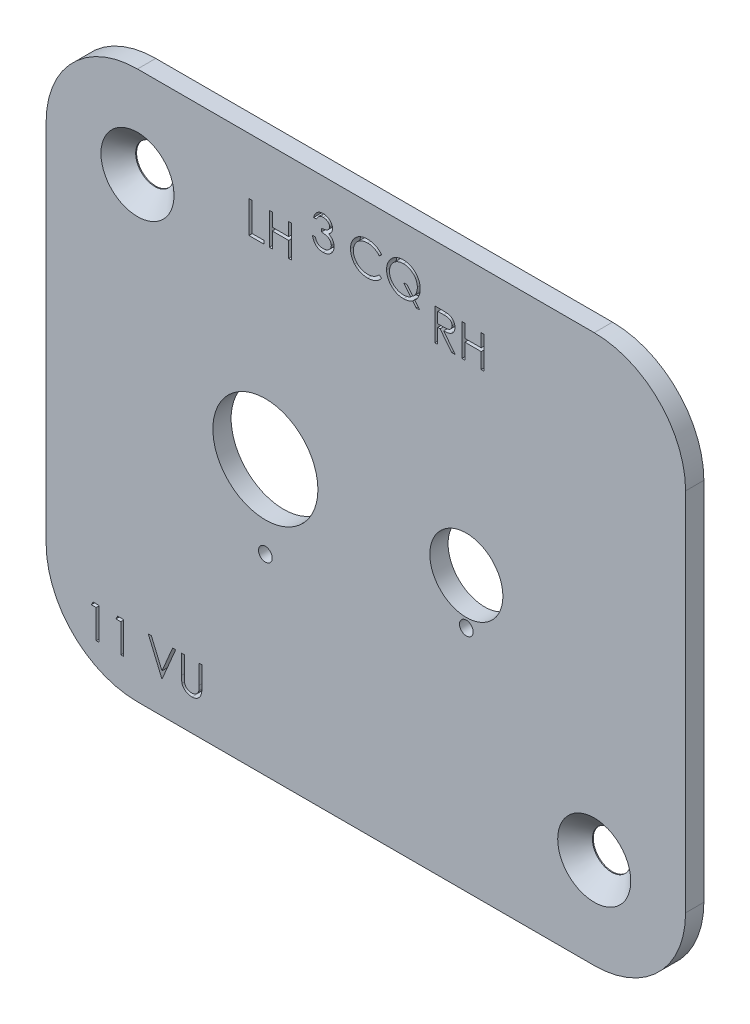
from build123d import *

# Parameters (mm, degrees)
ESQUISSE1_W             = 70
ESQUISSE1_H             = 60
BOSS_EXTRU_1_DEPTH      = 2
CONG_1_R                = 10
ESQUISSE2_R             = 2.1
ENL_V_MAT_EXTRU_1_DEPTH = 93.217135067
CHANFREIN1_SIZE         = 1.9
ENL_V_MAT_EXTRU_4_DEPTH = 1
ESQUISSE5_R             = 5.75
ESQUISSE5_R_2           = 4
ESQUISSE5_R_3           = 0.75
ENL_V_MAT_EXTRU_5_DEPTH = 93.217135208


with BuildPart() as part:
    # Esquisse1 → Boss.-Extru.1 (new body)
    with BuildSketch(Plane.XY):
        with Locations((35, 30)):
            Rectangle(ESQUISSE1_W, ESQUISSE1_H)
    extrude(amount=-BOSS_EXTRU_1_DEPTH)

    # Cong_1
    cong_1_edges = [part.edges().sort_by_distance(p)[0] for p in [
        (0, 60, -1),
        (70, 60, -1),
        (70, 0, -1),
        (0, 0, -1),
    ]]
    fillet(cong_1_edges, radius=CONG_1_R)

    # Esquisse2 → Enl_v. mat.-Extru.1 (cut, through all)
    with BuildSketch(Plane.XY):
        with Locations((10, 50)):
            Circle(ESQUISSE2_R)
        with Locations((60, 10)):
            Circle(ESQUISSE2_R)
    extrude(amount=-ENL_V_MAT_EXTRU_1_DEPTH, mode=Mode.SUBTRACT)

    # Chanfrein1
    chanfrein1_edges = [part.edges().sort_by_distance(p)[0] for p in [
        (7.9, 50, 0),
        (57.9, 10, 0),
    ]]
    chamfer(chanfrein1_edges, length=CHANFREIN1_SIZE)

    # Esquisse4 → Enl_v. mat.-Extru.4 (cut)
    # profile 1 of 11: a face of its own
    with BuildSketch(Plane.XY):
        Polygon((22.198120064, 53.814922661), (22.512222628, 53.814922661), (22.512222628, 50.67389702), (23.858376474, 50.67389702), (23.858376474, 50.314922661), (22.198120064, 50.314922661), align=None)
    # profile 2 of 11: a face of its own
    with BuildSketch(Plane.XY):
        Polygon((24.441709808, 53.814922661), (24.755812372, 53.814922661), (24.755812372, 52.379025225), (26.550684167, 52.379025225), (26.550684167, 53.814922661), (26.864786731, 53.814922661), (26.864786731, 50.314922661), (26.550684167, 50.314922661), (26.550684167, 52.020050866), (24.755812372, 52.020050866), (24.755812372, 50.314922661), (24.441709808, 50.314922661), align=None)
    # profile 3 of 11: a face of its own
    with BuildSketch(Plane.XY):
        with BuildLine():
            Line((42.552954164, 53.814922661), (43.253374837, 53.814922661))
            add(Edge.make_bspline(
                [(43.253374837, 53.814922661), (43.300115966, 53.814767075), (43.38986411, 53.814468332), (43.51843738, 53.812802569), (43.635264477, 53.808028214), (43.740284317, 53.80391963), (43.833494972, 53.796427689), (43.915182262, 53.789267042), (43.98496996, 53.779893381), (44.027215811, 53.771187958), (44.046343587, 53.767246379)],
                knots=[0, 0, 0, 0, 1.410062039, 2.707475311, 3.878576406, 4.937260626, 5.877586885, 6.699081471, 7.410979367, 8, 8, 8, 8], degree=3))
            add(Edge.make_bspline(
                [(44.046343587, 53.767246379), (44.071950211, 53.760919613), (44.122617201, 53.74840105), (44.195567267, 53.721941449), (44.265081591, 53.691321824), (44.330871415, 53.655358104), (44.392607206, 53.613783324), (44.450925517, 53.567315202), (44.50609098, 53.516207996), (44.555872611, 53.459173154), (44.602811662, 53.399336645), (44.642400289, 53.334632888), (44.676526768, 53.26697136), (44.703697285, 53.195663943), (44.725575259, 53.121402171), (44.741001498, 53.043513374), (44.750252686, 52.962352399), (44.751194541, 52.90699449), (44.751672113, 52.878925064)],
                knots=[0, 0, 0, 0, 1.027469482, 2.033020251, 3.019912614, 3.986113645, 4.951240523, 5.91722682, 6.890402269, 7.87763091, 8.8651537, 9.85103654, 10.82876324, 11.815024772, 12.821070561, 13.842952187, 14.906261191, 16, 16, 16, 16], degree=3))
            add(Edge.make_bspline(
                [(44.751672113, 52.878925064), (44.750203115, 52.83228996), (44.747336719, 52.741292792), (44.720611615, 52.609231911), (44.676835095, 52.486042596), (44.616511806, 52.371879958), (44.539692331, 52.268969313), (44.44736754, 52.178578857), (44.339485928, 52.102938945), (44.239056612, 52.05048614), (44.150342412, 52.016893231), (44.0773091, 51.993256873), (43.997642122, 51.974994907), (43.912104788, 51.958634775), (43.820341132, 51.946283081), (43.722571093, 51.937236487), (43.618724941, 51.931582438), (43.547385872, 51.930740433), (43.510686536, 51.930307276)],
                knots=[0, 0, 0, 0, 1.260483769, 2.459530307, 3.627416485, 4.787058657, 5.939039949, 7.08810263, 8.267026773, 9.491475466, 10.141966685, 10.831826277, 11.566392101, 12.351337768, 13.187381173, 14.07005841, 15.007169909, 16, 16, 16, 16], degree=3))
            Line((43.510686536, 51.930307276), (44.796543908, 50.314922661))
            Line((44.796543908, 50.314922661), (44.408122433, 50.314922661))
            Line((44.408122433, 50.314922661), (43.122265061, 51.930307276))
            Line((43.122265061, 51.930307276), (42.867056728, 51.930307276))
            Line((42.867056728, 51.930307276), (42.867056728, 50.314922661))
            Line((42.867056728, 50.314922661), (42.552954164, 50.314922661))
            Line((42.552954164, 50.314922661), (42.552954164, 53.814922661))
        make_face()
        with BuildLine():
            Line((42.867056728, 53.455948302), (42.867056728, 52.289281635))
            Line((42.867056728, 52.289281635), (43.507882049, 52.284373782))
            add(Edge.make_bspline(
                [(43.507882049, 52.284373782), (43.537802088, 52.284360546), (43.595795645, 52.284334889), (43.679696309, 52.288328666), (43.757816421, 52.292871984), (43.829857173, 52.299821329), (43.895850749, 52.308777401), (43.955764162, 52.319980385), (44.009695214, 52.333032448), (44.072593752, 52.353234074), (44.142830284, 52.385240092), (44.219161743, 52.431805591), (44.284164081, 52.49037471), (44.339081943, 52.557348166), (44.383211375, 52.630984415), (44.414323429, 52.710400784), (44.434065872, 52.793592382), (44.436394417, 52.85077049), (44.437569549, 52.879626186)],
                knots=[0, 0, 0, 0, 1.146690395, 2.22261258, 3.21895312, 4.145990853, 4.996080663, 5.770904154, 6.481378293, 7.121626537, 8.300444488, 9.431385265, 10.535395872, 11.636531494, 12.74115979, 13.810798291, 14.895190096, 16, 16, 16, 16], degree=3))
            add(Edge.make_bspline(
                [(44.437569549, 52.879626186), (44.436367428, 52.90777276), (44.433985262, 52.963548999), (44.414536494, 53.045204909), (44.381647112, 53.122271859), (44.337324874, 53.194436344), (44.283325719, 53.25994208), (44.220007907, 53.315989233), (44.149102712, 53.362238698), (44.082831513, 53.391793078), (44.023597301, 53.409912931), (43.972167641, 53.422664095), (43.914056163, 53.432908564), (43.848980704, 53.441116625), (43.777219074, 53.448171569), (43.698408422, 53.452923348), (43.613071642, 53.455737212), (43.553924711, 53.455876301), (43.523306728, 53.455948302)],
                knots=[0, 0, 0, 0, 1.101028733, 2.181837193, 3.264309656, 4.369019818, 5.486613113, 6.575447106, 7.666700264, 8.788928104, 9.402425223, 10.0903467, 10.862060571, 11.710948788, 12.657782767, 13.684531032, 14.801375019, 16, 16, 16, 16], degree=3))
            Line((43.523306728, 53.455948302), (42.867056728, 53.455948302))
        make_face(mode=Mode.SUBTRACT)
    # profile 4 of 11: a face of its own
    with BuildSketch(Plane.XY):
        Polygon((45.514492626, 53.814922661), (45.82859519, 53.814922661), (45.82859519, 52.379025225), (47.623466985, 52.379025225), (47.623466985, 53.814922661), (47.937569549, 53.814922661), (47.937569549, 50.314922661), (47.623466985, 50.314922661), (47.623466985, 52.020050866), (45.82859519, 52.020050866), (45.82859519, 50.314922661), (45.514492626, 50.314922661), align=None)
    # profile 5 of 11: a face of its own
    with BuildSketch(Plane.XY):
        with BuildLine():
            Line((29.596617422, 55.561562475), (29.282514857, 55.561562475))
            add(Edge.make_bspline(
                [(29.282514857, 55.561562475), (29.291024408, 55.596794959), (29.307659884, 55.665671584), (29.342357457, 55.764078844), (29.380156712, 55.857202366), (29.425545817, 55.94329844), (29.475054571, 56.024097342), (29.531777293, 56.097766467), (29.593097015, 56.166179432), (29.660921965, 56.22689267), (29.732050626, 56.281870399), (29.807485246, 56.328745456), (29.88570814, 56.369069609), (29.967261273, 56.402289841), (30.052387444, 56.427315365), (30.140317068, 56.44547217), (30.231280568, 56.457263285), (30.293028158, 56.458414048), (30.324381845, 56.458998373)],
                knots=[0, 0, 0, 0, 1.162005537, 2.271625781, 3.343758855, 4.383309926, 5.390229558, 6.379919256, 7.361854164, 8.333198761, 9.295911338, 10.242430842, 11.177959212, 12.116337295, 13.062827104, 14.020064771, 14.994644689, 16, 16, 16, 16], degree=3))
            add(Edge.make_bspline(
                [(30.324381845, 56.458998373), (30.370064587, 56.457619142), (30.460433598, 56.454890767), (30.593196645, 56.42997633), (30.721223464, 56.390551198), (30.843112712, 56.336077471), (30.956331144, 56.268890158), (31.057067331, 56.188925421), (31.143955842, 56.097726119), (31.216850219, 55.996993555), (31.273925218, 55.889338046), (31.316011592, 55.778537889), (31.341633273, 55.664855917), (31.34495383, 55.588098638), (31.346617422, 55.549643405)],
                knots=[0, 0, 0, 0, 1.083050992, 2.142477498, 3.193116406, 4.255571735, 5.30263384, 6.308962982, 7.297363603, 8.282367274, 9.249857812, 10.179914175, 11.08814088, 12, 12, 12, 12], degree=3))
            add(Edge.make_bspline(
                [(31.346617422, 55.549643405), (31.345453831, 55.51263661), (31.343176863, 55.440220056), (31.323843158, 55.334498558), (31.291306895, 55.234856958), (31.246237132, 55.140875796), (31.187895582, 55.053150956), (31.117222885, 54.971485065), (31.033720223, 54.895515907), (30.970441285, 54.851996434), (30.937863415, 54.829591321)],
                knots=[0, 0, 0, 0, 1.024540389, 2.004866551, 2.965041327, 3.920577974, 4.882998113, 5.874504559, 6.905732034, 8, 8, 8, 8], degree=3))
            add(Edge.make_bspline(
                [(30.937863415, 54.829591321), (30.97509517, 54.81161315), (31.048862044, 54.775993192), (31.149412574, 54.706137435), (31.240690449, 54.625481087), (31.291594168, 54.562538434), (31.317170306, 54.530913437)],
                knots=[0, 0, 0, 0, 1.015518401, 2.012035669, 3.001164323, 4, 4, 4, 4], degree=3))
            add(Edge.make_bspline(
                [(31.317170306, 54.530913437), (31.334011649, 54.507855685), (31.367418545, 54.462117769), (31.408654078, 54.388581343), (31.446063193, 54.314229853), (31.475213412, 54.237070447), (31.497787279, 54.157997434), (31.513923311, 54.076875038), (31.523947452, 53.993637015), (31.525383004, 53.937324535), (31.526104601, 53.909018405)],
                knots=[0, 0, 0, 0, 1.025084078, 2.033381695, 3.024893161, 4.013698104, 4.991890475, 5.976764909, 6.982997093, 8, 8, 8, 8], degree=3))
            add(Edge.make_bspline(
                [(31.526104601, 53.909018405), (31.524310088, 53.860008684), (31.520729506, 53.762219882), (31.488725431, 53.61774516), (31.439112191, 53.476519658), (31.368655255, 53.341444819), (31.282787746, 53.215064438), (31.180630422, 53.101988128), (31.063344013, 53.004789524), (30.932538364, 52.923579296), (30.790821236, 52.858661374), (30.639245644, 52.813603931), (30.47999559, 52.784257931), (30.370788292, 52.781111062), (30.315267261, 52.779511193)],
                knots=[0, 0, 0, 0, 0.955779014, 1.907060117, 2.875433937, 3.871313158, 4.872415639, 5.851225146, 6.836215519, 7.83643374, 8.849228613, 9.86973379, 10.916971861, 12, 12, 12, 12], degree=3))
            add(Edge.make_bspline(
                [(30.315267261, 52.779511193), (30.277847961, 52.780379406), (30.204219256, 52.782087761), (30.095975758, 52.793766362), (29.992654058, 52.815096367), (29.89411446, 52.843799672), (29.800269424, 52.880191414), (29.711405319, 52.925510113), (29.626975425, 52.978821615), (29.547776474, 53.040755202), (29.473817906, 53.110036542), (29.407065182, 53.187895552), (29.346405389, 53.272892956), (29.293462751, 53.366016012), (29.245825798, 53.466061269), (29.206644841, 53.574309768), (29.172159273, 53.68979379), (29.156125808, 53.77027153), (29.147899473, 53.811562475)],
                knots=[0, 0, 0, 0, 1.048658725, 2.063410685, 3.046034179, 4.001477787, 4.936774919, 5.862367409, 6.792675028, 7.730719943, 8.675894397, 9.627829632, 10.600096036, 11.597688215, 12.626045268, 13.701542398, 14.82072376, 16, 16, 16, 16], degree=3))
            Line((29.147899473, 53.811562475), (29.462002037, 53.811562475))
            add(Edge.make_bspline(
                [(29.462002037, 53.811562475), (29.470185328, 53.784613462), (29.486102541, 53.73219529), (29.513196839, 53.656754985), (29.544065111, 53.587596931), (29.57717967, 53.524213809), (29.611958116, 53.465981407), (29.650873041, 53.414439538), (29.691042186, 53.367324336), (29.721321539, 53.340779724), (29.736140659, 53.327788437)],
                knots=[0, 0, 0, 0, 1.198163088, 2.33053128, 3.407730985, 4.417276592, 5.372219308, 6.28897303, 7.162600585, 8, 8, 8, 8], degree=3))
            add(Edge.make_bspline(
                [(29.736140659, 53.327788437), (29.755737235, 53.312680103), (29.794869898, 53.282510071), (29.858638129, 53.244008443), (29.925703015, 53.210647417), (29.99751769, 53.185163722), (30.07253246, 53.163586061), (30.151959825, 53.149465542), (30.235099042, 53.13977737), (30.291866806, 53.138922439), (30.320876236, 53.138485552)],
                knots=[0, 0, 0, 0, 0.946170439, 1.889420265, 2.845303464, 3.807233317, 4.801018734, 5.828864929, 6.890507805, 8, 8, 8, 8], degree=3))
            add(Edge.make_bspline(
                [(30.320876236, 53.138485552), (30.353629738, 53.139101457), (30.417676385, 53.140305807), (30.511131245, 53.151381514), (30.600038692, 53.167511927), (30.683411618, 53.19242491), (30.762342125, 53.223205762), (30.835723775, 53.261854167), (30.904519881, 53.307198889), (30.967849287, 53.358738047), (31.024794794, 53.415159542), (31.074934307, 53.474172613), (31.117558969, 53.535528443), (31.151942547, 53.599566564), (31.179093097, 53.666021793), (31.197576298, 53.735080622), (31.210427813, 53.806177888), (31.211474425, 53.854506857), (31.212002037, 53.878870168)],
                knots=[0, 0, 0, 0, 1.217147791, 2.380027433, 3.494444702, 4.572153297, 5.609568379, 6.639424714, 7.649109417, 8.668170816, 9.669597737, 10.625200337, 11.543417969, 12.441394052, 13.322311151, 14.205496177, 15.095365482, 16, 16, 16, 16], degree=3))
            add(Edge.make_bspline(
                [(31.212002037, 53.878870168), (31.210471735, 53.911481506), (31.207418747, 53.976541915), (31.184110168, 54.072259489), (31.145771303, 54.164482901), (31.092098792, 54.251638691), (31.026763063, 54.332414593), (30.950398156, 54.404486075), (30.862369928, 54.463956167), (30.781350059, 54.505044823), (30.709584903, 54.533081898), (30.648169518, 54.551756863), (30.579412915, 54.567570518), (30.504146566, 54.58228279), (30.421803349, 54.594804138), (30.332472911, 54.605245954), (30.23613715, 54.613600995), (30.169445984, 54.61733209), (30.13507896, 54.619254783)],
                knots=[0, 0, 0, 0, 1.07054697, 2.135767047, 3.216561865, 4.33974944, 5.486079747, 6.621378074, 7.775625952, 8.963672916, 9.598146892, 10.304877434, 11.070270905, 11.915000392, 12.823868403, 13.805723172, 14.86925407, 16, 16, 16, 16], degree=3))
            Line((30.13507896, 54.619254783), (30.13507896, 54.978229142))
            add(Edge.make_bspline(
                [(30.13507896, 54.978229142), (30.178380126, 54.978963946), (30.263196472, 54.980403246), (30.387090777, 54.997811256), (30.505564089, 55.021891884), (30.615990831, 55.058777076), (30.716639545, 55.101617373), (30.803959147, 55.151469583), (30.876726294, 55.206884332), (30.934587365, 55.268716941), (30.978116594, 55.335031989), (31.009943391, 55.404148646), (31.028743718, 55.476672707), (31.031253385, 55.526167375), (31.032514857, 55.551045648)],
                knots=[0, 0, 0, 0, 1.321986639, 2.589447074, 3.816329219, 5.01088745, 6.139805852, 7.153945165, 8.075214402, 8.924034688, 9.728124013, 10.488707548, 11.240355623, 12, 12, 12, 12], degree=3))
            add(Edge.make_bspline(
                [(31.032514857, 55.551045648), (31.032100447, 55.569323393), (31.031275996, 55.605686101), (31.020878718, 55.658811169), (31.005254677, 55.710312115), (30.983774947, 55.759969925), (30.955024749, 55.807440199), (30.920618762, 55.853127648), (30.879650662, 55.896771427), (30.832705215, 55.937451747), (30.78229341, 55.976220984), (30.727043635, 56.009134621), (30.66862176, 56.037279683), (30.606963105, 56.060489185), (30.541867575, 56.077948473), (30.473641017, 56.090484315), (30.402153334, 56.098321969), (30.353381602, 56.099450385), (30.328588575, 56.100024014)],
                knots=[0, 0, 0, 0, 0.884392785, 1.759457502, 2.611959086, 3.489218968, 4.37281399, 5.2945488, 6.255912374, 7.266815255, 8.301784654, 9.332968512, 10.37626691, 11.440494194, 12.520033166, 13.637162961, 14.798855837, 16, 16, 16, 16], degree=3))
            add(Edge.make_bspline(
                [(30.328588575, 56.100024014), (30.288736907, 56.098632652), (30.210897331, 56.095914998), (30.098682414, 56.072111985), (29.99436308, 56.034133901), (29.914624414, 55.988800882), (29.855741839, 55.944050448), (29.813664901, 55.904968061), (29.772344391, 55.861535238), (29.734498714, 55.811076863), (29.696224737, 55.757010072), (29.661380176, 55.696586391), (29.627520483, 55.631381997), (29.607117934, 55.585286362), (29.596617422, 55.561562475)],
                knots=[0, 0, 0, 0, 1.472543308, 2.876219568, 4.221790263, 5.565193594, 6.249813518, 6.953379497, 7.687249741, 8.463570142, 9.283606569, 10.136032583, 11.040678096, 12, 12, 12, 12], degree=3))
        make_face()
    # profile 6 of 11: a face of its own
    with BuildSketch(Plane.XY):
        with BuildLine():
            Line((36.731232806, 55.727027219), (36.456393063, 55.51669068))
            add(Edge.make_bspline(
                [(36.456393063, 55.51669068), (36.436787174, 55.54005665), (36.397839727, 55.586473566), (36.335180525, 55.65165311), (36.269878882, 55.712718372), (36.201959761, 55.769960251), (36.130200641, 55.821377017), (36.056339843, 55.86964812), (35.979141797, 55.912915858), (35.872390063, 55.965378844), (35.732742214, 56.020124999), (35.556947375, 56.06602823), (35.373436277, 56.095249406), (35.248238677, 56.098414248), (35.184558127, 56.100024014)],
                knots=[0, 0, 0, 0, 0.757959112, 1.505699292, 2.245454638, 2.979532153, 3.711538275, 4.438200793, 5.171680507, 5.909471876, 7.393775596, 8.890124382, 10.418191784, 12, 12, 12, 12], degree=3))
            add(Edge.make_bspline(
                [(35.184558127, 56.100024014), (35.149474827, 56.099620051), (35.079633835, 56.098815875), (34.975985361, 56.08820675), (34.87427231, 56.07329554), (34.774560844, 56.051170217), (34.676977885, 56.023197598), (34.580885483, 55.989772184), (34.487674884, 55.948417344), (34.396056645, 55.902709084), (34.308277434, 55.851081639), (34.225222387, 55.794768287), (34.147194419, 55.734399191), (34.074131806, 55.669748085), (34.005959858, 55.601106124), (33.943172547, 55.527741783), (33.885987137, 55.449889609), (33.833270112, 55.368576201), (33.786057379, 55.28403841), (33.746527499, 55.195963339), (33.711522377, 55.105859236), (33.683823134, 55.012708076), (33.661898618, 54.91716531), (33.646770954, 54.818974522), (33.636282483, 54.718340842), (33.635482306, 54.65013153), (33.63507896, 54.615749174)],
                knots=[0, 0, 0, 0, 1.054917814, 2.100044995, 3.131103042, 4.146048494, 5.169673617, 6.183595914, 7.203665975, 8.234915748, 9.262203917, 10.264457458, 11.251630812, 12.227803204, 13.197192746, 14.159520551, 15.12972552, 16.100847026, 17.073214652, 18.039054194, 19.002613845, 19.979014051, 20.95965708, 21.949030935, 22.966165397, 24, 24, 24, 24], degree=3))
            add(Edge.make_bspline(
                [(33.63507896, 54.615749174), (33.636340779, 54.564017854), (33.638818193, 54.462450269), (33.660866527, 54.313679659), (33.694371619, 54.171158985), (33.744587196, 54.035779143), (33.806506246, 53.905870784), (33.884746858, 53.783631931), (33.975363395, 53.667215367), (34.079637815, 53.559372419), (34.194043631, 53.460858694), (34.316791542, 53.374108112), (34.44757583, 53.30179323), (34.58495246, 53.241617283), (34.729978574, 53.195360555), (34.882393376, 53.162796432), (35.041865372, 53.141554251), (35.150834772, 53.139520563), (35.206292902, 53.138485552)],
                knots=[0, 0, 0, 0, 1.029171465, 2.020641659, 2.987623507, 3.938342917, 4.889210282, 5.84687017, 6.821220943, 7.821438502, 8.827599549, 9.822697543, 10.807740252, 11.797342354, 12.80366471, 13.83203677, 14.896651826, 16, 16, 16, 16], degree=3))
            add(Edge.make_bspline(
                [(35.206292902, 53.138485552), (35.267395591, 53.140174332), (35.3876603, 53.143498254), (35.564028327, 53.171657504), (35.732864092, 53.217315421), (35.894176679, 53.281213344), (36.047511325, 53.364278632), (36.193107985, 53.464976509), (36.331089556, 53.584264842), (36.414060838, 53.67534797), (36.456393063, 53.721818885)],
                knots=[0, 0, 0, 0, 1.028121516, 2.023589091, 2.998037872, 3.967518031, 4.937445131, 5.927275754, 6.942489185, 8, 8, 8, 8], degree=3))
            Line((36.456393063, 53.721818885), (36.731232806, 53.513585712))
            add(Edge.make_bspline(
                [(36.731232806, 53.513585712), (36.709114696, 53.48504726), (36.664984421, 53.428107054), (36.593526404, 53.347835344), (36.518249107, 53.272331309), (36.438593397, 53.202203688), (36.355475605, 53.136049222), (36.267403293, 53.075747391), (36.17553426, 53.020456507), (36.080179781, 52.969829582), (35.981441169, 52.924912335), (35.879436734, 52.886458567), (35.774606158, 52.853333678), (35.66694465, 52.826081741), (35.556228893, 52.804810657), (35.442858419, 52.790590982), (35.326588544, 52.780849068), (35.248147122, 52.779961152), (35.208396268, 52.779511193)],
                knots=[0, 0, 0, 0, 0.986787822, 1.968848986, 2.935600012, 3.899624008, 4.868462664, 5.837806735, 6.815139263, 7.798259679, 8.787526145, 9.778297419, 10.776456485, 11.791383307, 12.812564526, 13.85620153, 14.913611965, 16, 16, 16, 16], degree=3))
            add(Edge.make_bspline(
                [(35.208396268, 52.779511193), (35.170752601, 52.779773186), (35.096316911, 52.780291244), (34.986418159, 52.788683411), (34.879428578, 52.800133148), (34.775653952, 52.817373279), (34.674527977, 52.837717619), (34.576967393, 52.864988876), (34.482012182, 52.895538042), (34.390043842, 52.931443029), (34.300984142, 52.971959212), (34.215120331, 53.01775077), (34.132491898, 53.068432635), (34.052286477, 53.122887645), (33.975688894, 53.182864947), (33.902035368, 53.247531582), (33.830912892, 53.316669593), (33.786910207, 53.366524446), (33.764786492, 53.39159052)],
                knots=[0, 0, 0, 0, 1.114604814, 2.203992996, 3.262667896, 4.300477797, 5.318619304, 6.316056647, 7.298880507, 8.271930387, 9.238335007, 10.195173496, 11.151986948, 12.108099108, 13.064862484, 14.031167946, 15.010108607, 16, 16, 16, 16], degree=3))
            add(Edge.make_bspline(
                [(33.764786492, 53.39159052), (33.729350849, 53.435131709), (33.658907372, 53.521688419), (33.568781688, 53.661974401), (33.491634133, 53.80844261), (33.429258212, 53.961862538), (33.380495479, 54.121889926), (33.346714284, 54.28860544), (33.32476268, 54.461853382), (33.322252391, 54.579690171), (33.320976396, 54.639587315)],
                knots=[0, 0, 0, 0, 0.994628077, 1.977248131, 2.950237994, 3.925870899, 4.908910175, 5.911660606, 6.938484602, 8, 8, 8, 8], degree=3))
            add(Edge.make_bspline(
                [(33.320976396, 54.639587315), (33.322531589, 54.702542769), (33.325591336, 54.826403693), (33.351587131, 55.008177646), (33.393405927, 55.182329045), (33.452802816, 55.34853279), (33.528108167, 55.50766307), (33.621134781, 55.658504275), (33.730801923, 55.802021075), (33.856249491, 55.936035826), (33.993816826, 56.058575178), (34.14113564, 56.166381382), (34.297917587, 56.256098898), (34.462435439, 56.331095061), (34.63592112, 56.388739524), (34.81800449, 56.42909271), (35.008343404, 56.454209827), (35.13820583, 56.457385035), (35.204189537, 56.458998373)],
                knots=[0, 0, 0, 0, 1.032925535, 2.032216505, 3.007276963, 3.968222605, 4.92396291, 5.891752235, 6.871517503, 7.883894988, 8.900124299, 9.891468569, 10.874487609, 11.85992873, 12.854644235, 13.869047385, 14.917252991, 16, 16, 16, 16], degree=3))
            add(Edge.make_bspline(
                [(35.204189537, 56.458998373), (35.244404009, 56.458516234), (35.324004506, 56.45756189), (35.441757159, 56.448255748), (35.556399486, 56.432742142), (35.668010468, 56.411626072), (35.777133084, 56.385418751), (35.882933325, 56.351278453), (35.986032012, 56.312241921), (36.08577892, 56.267283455), (36.18169547, 56.216816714), (36.273751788, 56.16140109), (36.361216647, 56.101105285), (36.444705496, 56.036442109), (36.522821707, 55.96604355), (36.597783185, 55.891845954), (36.667044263, 55.81171213), (36.709797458, 55.755307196), (36.731232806, 55.727027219)],
                knots=[0, 0, 0, 0, 1.096760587, 2.17092713, 3.219439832, 4.250915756, 5.268269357, 6.278326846, 7.281116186, 8.274029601, 9.260640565, 10.235837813, 11.203064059, 12.156899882, 13.114053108, 14.069676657, 15.032185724, 16, 16, 16, 16], degree=3))
        make_face()
    # profile 7 of 11: a face of its own
    with BuildSketch(Plane.XY):
        with BuildLine():
            Line((40.366549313, 53.259078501), (40.904309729, 52.600024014))
            Line((40.904309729, 52.600024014), (40.512382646, 52.600024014))
            Line((40.512382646, 52.600024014), (40.123961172, 53.075384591))
            add(Edge.make_bspline(
                [(40.123961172, 53.075384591), (40.085004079, 53.051710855), (40.007807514, 53.004799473), (39.887440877, 52.944333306), (39.764680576, 52.894017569), (39.639798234, 52.852447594), (39.512975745, 52.819173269), (39.383570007, 52.79607948), (39.252050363, 52.782669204), (39.163687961, 52.780567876), (39.11925364, 52.779511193)],
                knots=[0, 0, 0, 0, 1.030216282, 2.041455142, 3.041201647, 4.026904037, 5.014869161, 6.002481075, 6.995518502, 8, 8, 8, 8], degree=3))
            add(Edge.make_bspline(
                [(39.11925364, 52.779511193), (39.055593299, 52.78104454), (38.930328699, 52.784061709), (38.746358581, 52.810402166), (38.569774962, 52.851082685), (38.400929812, 52.909943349), (38.2396392, 52.985125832), (38.085978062, 53.077815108), (37.939868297, 53.186727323), (37.803466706, 53.311150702), (37.678741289, 53.446506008), (37.56930255, 53.591127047), (37.476250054, 53.742614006), (37.401011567, 53.901722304), (37.341299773, 54.067066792), (37.300607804, 54.240022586), (37.274268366, 54.419560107), (37.271233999, 54.541803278), (37.269694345, 54.603830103)],
                knots=[0, 0, 0, 0, 1.055750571, 2.07740284, 3.077223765, 4.05828044, 5.038417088, 6.02463293, 7.030503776, 8.057169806, 9.083586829, 10.080154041, 11.061747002, 12.027853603, 12.995569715, 13.972756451, 14.971366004, 16, 16, 16, 16], degree=3))
            add(Edge.make_bspline(
                [(37.269694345, 54.603830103), (37.270242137, 54.645461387), (37.271333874, 54.728431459), (37.283963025, 54.851318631), (37.302726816, 54.972182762), (37.329267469, 55.090521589), (37.364011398, 55.206820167), (37.405665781, 55.320849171), (37.456135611, 55.43231478), (37.51319053, 55.540988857), (37.57682313, 55.645929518), (37.646139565, 55.745643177), (37.721310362, 55.83914715), (37.802282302, 55.926398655), (37.888732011, 56.007590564), (37.979916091, 56.084059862), (38.077778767, 56.152961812), (38.179737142, 56.217037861), (38.286362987, 56.273383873), (38.395570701, 56.323755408), (38.508177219, 56.364625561), (38.622721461, 56.399451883), (38.739898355, 56.426039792), (38.859616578, 56.444666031), (38.981791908, 56.457416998), (39.064299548, 56.458468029), (39.105932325, 56.458998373)],
                knots=[0, 0, 0, 0, 1.030721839, 2.054201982, 3.056261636, 4.058906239, 5.055198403, 6.060579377, 7.06322398, 8.083343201, 9.098870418, 10.10084648, 11.0888991, 12.067804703, 13.046436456, 14.024708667, 15.012489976, 16.008294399, 17.005242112, 17.997338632, 18.984424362, 19.969624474, 20.960977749, 21.957320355, 22.969278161, 24, 24, 24, 24], degree=3))
            add(Edge.make_bspline(
                [(39.105932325, 56.458998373), (39.169592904, 56.457472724), (39.294626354, 56.454476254), (39.478140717, 56.428131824), (39.654204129, 56.387288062), (39.822691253, 56.328727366), (39.983451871, 56.253355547), (40.136418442, 56.160684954), (40.281828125, 56.051765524), (40.417516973, 55.927333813), (40.541948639, 55.791644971), (40.65086824, 55.646235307), (40.743538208, 55.493268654), (40.81891234, 55.332508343), (40.877464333, 55.164020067), (40.918393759, 54.987735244), (40.944612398, 54.803968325), (40.947641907, 54.67870682), (40.949181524, 54.615048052)],
                knots=[0, 0, 0, 0, 1.050672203, 2.063587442, 3.054842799, 4.031180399, 5.003107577, 5.981273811, 6.979214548, 7.998088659, 9.016962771, 10.014903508, 10.993069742, 11.96499692, 12.941334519, 13.932589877, 14.949327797, 16, 16, 16, 16], degree=3))
            add(Edge.make_bspline(
                [(40.949181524, 54.615048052), (40.947498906, 54.548810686), (40.944190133, 54.418558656), (40.916031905, 54.22755793), (40.870758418, 54.045107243), (40.806555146, 53.871326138), (40.723554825, 53.706246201), (40.623360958, 53.548216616), (40.504767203, 53.397248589), (40.413107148, 53.305620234), (40.366549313, 53.259078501)],
                knots=[0, 0, 0, 0, 1.045660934, 2.056233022, 3.041853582, 4.009978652, 4.97562384, 5.954545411, 6.961031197, 8, 8, 8, 8], degree=3))
        make_face()
        with BuildLine():
            add(Edge.make_bspline(
                [(40.155511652, 53.517792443), (40.193700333, 53.556575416), (40.268819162, 53.632863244), (40.366284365, 53.757971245), (40.450114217, 53.888018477), (40.517229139, 54.024734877), (40.570628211, 54.16640759), (40.607521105, 54.314159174), (40.630621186, 54.467316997), (40.63358211, 54.571496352), (40.63507896, 54.624162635)],
                knots=[0, 0, 0, 0, 1.052210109, 2.069743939, 3.061837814, 4.040478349, 5.010453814, 5.985306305, 6.981502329, 8, 8, 8, 8], degree=3))
            add(Edge.make_bspline(
                [(40.63507896, 54.624162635), (40.634687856, 54.658079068), (40.633914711, 54.725125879), (40.623283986, 54.824343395), (40.608244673, 54.921369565), (40.586472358, 55.016031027), (40.558434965, 55.108135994), (40.523806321, 55.197559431), (40.483261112, 55.284589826), (40.435994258, 55.36868655), (40.38388655, 55.449727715), (40.325884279, 55.526722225), (40.262803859, 55.599273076), (40.195334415, 55.668575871), (40.122175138, 55.733202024), (40.043588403, 55.793123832), (39.960542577, 55.849791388), (39.872626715, 55.900941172), (39.782029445, 55.947965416), (39.689280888, 55.988685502), (39.595159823, 56.023173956), (39.499812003, 56.051139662), (39.403360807, 56.073152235), (39.305637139, 56.08817472), (39.20689371, 56.098794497), (39.14054924, 56.099613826), (39.107334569, 56.100024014)],
                knots=[0, 0, 0, 0, 1.032958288, 2.041976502, 3.037103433, 4.023477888, 4.998866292, 5.968231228, 6.943073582, 7.921783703, 8.90545537, 9.876780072, 10.85618943, 11.833110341, 12.821898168, 13.827467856, 14.842673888, 15.88323808, 16.924703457, 17.951432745, 18.967462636, 19.976958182, 20.977218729, 21.979378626, 22.98839684, 24, 24, 24, 24], degree=3))
            add(Edge.make_bspline(
                [(39.107334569, 56.100024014), (39.073886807, 56.099610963), (39.0070772, 56.098785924), (38.907857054, 56.088233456), (38.809909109, 56.073135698), (38.71366416, 56.05123253), (38.618781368, 56.023212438), (38.525555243, 55.988515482), (38.433175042, 55.948801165), (38.34355774, 55.901806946), (38.256860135, 55.850217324), (38.174405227, 55.794113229), (38.097323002, 55.732934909), (38.02488226, 55.66766733), (37.957263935, 55.597806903), (37.894148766, 55.523818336), (37.836645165, 55.444843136), (37.783961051, 55.362294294), (37.737396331, 55.276082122), (37.695400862, 55.187762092), (37.661291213, 55.096360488), (37.633287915, 55.002608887), (37.610404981, 54.906740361), (37.595656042, 54.808198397), (37.584945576, 54.707598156), (37.584182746, 54.639617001), (37.583796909, 54.605232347)],
                knots=[0, 0, 0, 0, 1.013205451, 2.023808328, 3.020541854, 4.015386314, 5.012622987, 6.016502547, 7.02834558, 8.057881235, 9.080621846, 10.084476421, 11.077781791, 12.060654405, 13.037357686, 14.022218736, 15.005346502, 15.995617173, 16.98763393, 17.973029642, 18.956998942, 19.940662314, 20.93709383, 21.940823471, 22.958474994, 24, 24, 24, 24], degree=3))
            add(Edge.make_bspline(
                [(37.583796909, 54.605232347), (37.585110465, 54.554679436), (37.587694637, 54.45522622), (37.609116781, 54.309211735), (37.645033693, 54.169425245), (37.695282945, 54.035666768), (37.758363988, 53.907165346), (37.836810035, 53.785179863), (37.930286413, 53.670174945), (38.03525687, 53.561360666), (38.15072594, 53.462779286), (38.273134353, 53.376016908), (38.401437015, 53.302406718), (38.536036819, 53.242994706), (38.675930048, 53.19528485), (38.822221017, 53.162984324), (38.973953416, 53.141574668), (39.077344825, 53.139524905), (39.129770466, 53.138485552)],
                knots=[0, 0, 0, 0, 1.022526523, 2.011626, 2.97850031, 3.937665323, 4.897797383, 5.869804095, 6.865337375, 7.89202157, 8.925035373, 9.93268082, 10.923937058, 11.912550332, 12.905497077, 13.90928476, 14.939882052, 16, 16, 16, 16], degree=3))
            add(Edge.make_bspline(
                [(39.129770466, 53.138485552), (39.16578887, 53.138877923), (39.23703073, 53.139654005), (39.342084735, 53.150234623), (39.44456796, 53.165127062), (39.543531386, 53.187777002), (39.639833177, 53.21593586), (39.732900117, 53.250188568), (39.82322589, 53.290795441), (39.880658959, 53.322920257), (39.909417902, 53.339006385)],
                knots=[0, 0, 0, 0, 1.060694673, 2.097979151, 3.107774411, 4.11000626, 5.086069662, 6.061987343, 7.029562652, 8, 8, 8, 8], degree=3))
            Line((39.909417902, 53.339006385), (39.121357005, 54.305152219))
            Line((39.121357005, 54.305152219), (39.513284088, 54.305152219))
            Line((39.513284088, 54.305152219), (40.155511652, 53.517792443))
        make_face(mode=Mode.SUBTRACT)
    # profile 8 of 11: a face of its own
    with BuildSketch(Plane.XY):
        Polygon((5.146697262, 7.03871567), (5.793832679, 7.03871567), (5.793832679, 3.53871567), (5.479730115, 3.53871567), (5.479730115, 6.679741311), (4.941268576, 6.679741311), align=None)
    # profile 9 of 11: a face of its own
    with BuildSketch(Plane.XY):
        Polygon((7.839004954, 7.03871567), (8.486140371, 7.03871567), (8.486140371, 3.53871567), (8.172037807, 3.53871567), (8.172037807, 6.679741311), (7.633576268, 6.679741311), align=None)
    # profile 10 of 11: a face of its own
    with BuildSketch(Plane.XY):
        Polygon((11.178448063, 7.03871567), (11.514986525, 7.03871567), (12.681653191, 4.280502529), (13.848319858, 7.03871567), (14.18485832, 7.03871567), (12.704089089, 3.53871567), (12.659217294, 3.53871567), align=None)
    # profile 11 of 11: a face of its own
    with BuildSketch(Plane.XY):
        with BuildLine():
            Line((14.813063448, 7.03871567), (15.127166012, 7.03871567))
            Line((15.127166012, 7.03871567), (15.127166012, 4.941660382))
            add(Edge.make_bspline(
                [(15.127166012, 4.941660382), (15.127119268, 4.911979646), (15.127030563, 4.855655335), (15.127623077, 4.775487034), (15.129282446, 4.704214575), (15.130328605, 4.641563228), (15.132655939, 4.58782048), (15.134553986, 4.54269517), (15.136994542, 4.506400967), (15.13992766, 4.485220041), (15.141188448, 4.47611551)],
                knots=[0, 0, 0, 0, 1.528628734, 2.90083645, 4.128790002, 5.200304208, 6.127813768, 6.898992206, 7.526736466, 8, 8, 8, 8], degree=3))
            add(Edge.make_bspline(
                [(15.141188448, 4.47611551), (15.146365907, 4.443268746), (15.156429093, 4.379426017), (15.182075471, 4.288517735), (15.217892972, 4.206586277), (15.260336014, 4.131074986), (15.316268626, 4.064085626), (15.383272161, 4.002373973), (15.46444993, 3.948402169), (15.554710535, 3.899051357), (15.651995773, 3.859386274), (15.751407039, 3.82939291), (15.851450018, 3.81111401), (15.918426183, 3.808997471), (15.951685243, 3.807946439)],
                knots=[0, 0, 0, 0, 1.035780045, 2.013197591, 2.933192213, 3.817615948, 4.702609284, 5.640816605, 6.646850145, 7.73207398, 8.84249596, 9.914020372, 10.964143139, 12, 12, 12, 12], degree=3))
            add(Edge.make_bspline(
                [(15.951685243, 3.807946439), (15.980238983, 3.80902029), (16.037181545, 3.811161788), (16.121787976, 3.824423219), (16.204188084, 3.848323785), (16.284788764, 3.879163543), (16.360339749, 3.919911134), (16.430883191, 3.966981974), (16.493847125, 4.02219285), (16.551305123, 4.083293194), (16.601340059, 4.152232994), (16.6447112, 4.227511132), (16.68023713, 4.310260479), (16.697780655, 4.368414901), (16.706793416, 4.398290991)],
                knots=[0, 0, 0, 0, 0.994687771, 1.983630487, 2.973142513, 3.978332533, 4.983357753, 5.956394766, 6.925816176, 7.893390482, 8.871859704, 9.88551698, 10.913711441, 12, 12, 12, 12], degree=3))
            add(Edge.make_bspline(
                [(16.706793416, 4.398290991), (16.709793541, 4.410639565), (16.716479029, 4.438157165), (16.722726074, 4.484678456), (16.7292326, 4.539567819), (16.73374717, 4.603219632), (16.73814839, 4.675420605), (16.740781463, 4.756546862), (16.741998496, 4.846303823), (16.742361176, 4.908940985), (16.742550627, 4.941660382)],
                knots=[0, 0, 0, 0, 0.558680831, 1.244966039, 2.062412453, 2.990489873, 4.051219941, 5.244515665, 6.560634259, 8, 8, 8, 8], degree=3))
            Line((16.742550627, 4.941660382), (16.742550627, 7.03871567))
            Line((16.742550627, 7.03871567), (17.056653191, 7.03871567))
            Line((17.056653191, 7.03871567), (17.056653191, 4.924833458))
            add(Edge.make_bspline(
                [(17.056653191, 4.924833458), (17.056399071, 4.88673508), (17.05590314, 4.812383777), (17.051602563, 4.703432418), (17.044745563, 4.600079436), (17.035057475, 4.50231094), (17.022220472, 4.410476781), (17.007945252, 4.323772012), (16.989765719, 4.24281902), (16.968532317, 4.166986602), (16.944258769, 4.094801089), (16.912817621, 4.026292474), (16.877393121, 3.959378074), (16.835378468, 3.895069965), (16.788167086, 3.833083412), (16.734715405, 3.773794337), (16.676791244, 3.716255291), (16.613431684, 3.661942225), (16.545681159, 3.612133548), (16.473741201, 3.568335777), (16.398164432, 3.531312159), (16.319147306, 3.500836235), (16.236656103, 3.477921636), (16.150688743, 3.46084648), (16.06104955, 3.451144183), (16.000084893, 3.449702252), (15.969213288, 3.44897208)],
                knots=[0, 0, 0, 0, 1.316592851, 2.569410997, 3.76748051, 4.895814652, 5.963796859, 6.97159953, 7.931736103, 8.829262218, 9.692595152, 10.560224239, 11.431080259, 12.30701507, 13.211635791, 14.121146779, 15.063487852, 16.031507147, 17.00238618, 17.966455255, 18.938106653, 19.907068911, 20.888905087, 21.893141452, 22.933117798, 24, 24, 24, 24], degree=3))
            add(Edge.make_bspline(
                [(15.969213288, 3.44897208), (15.935544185, 3.449756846), (15.869485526, 3.451296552), (15.772147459, 3.460119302), (15.678833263, 3.476737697), (15.588557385, 3.49789764), (15.502548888, 3.527081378), (15.419655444, 3.561179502), (15.341296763, 3.603056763), (15.266201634, 3.649650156), (15.196376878, 3.702074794), (15.132279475, 3.759214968), (15.073803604, 3.820155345), (15.021934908, 3.885555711), (14.975814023, 3.954907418), (14.93608381, 4.028406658), (14.901970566, 4.106024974), (14.884363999, 4.159978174), (14.875463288, 4.18725333)],
                knots=[0, 0, 0, 0, 1.13879206, 2.234305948, 3.301075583, 4.341971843, 5.366689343, 6.369221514, 7.369726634, 8.367512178, 9.355451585, 10.318319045, 11.268648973, 12.207971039, 13.137398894, 14.081662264, 15.030215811, 16, 16, 16, 16], degree=3))
            add(Edge.make_bspline(
                [(14.875463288, 4.18725333), (14.870286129, 4.205885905), (14.859056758, 4.246300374), (14.84703146, 4.313186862), (14.836922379, 4.39020178), (14.827416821, 4.477350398), (14.821807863, 4.574700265), (14.816890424, 4.682209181), (14.813028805, 4.800007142), (14.813051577, 4.882061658), (14.813063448, 4.924833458)],
                knots=[0, 0, 0, 0, 0.625038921, 1.35572334, 2.194682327, 3.136881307, 4.189498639, 5.346923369, 6.617055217, 8, 8, 8, 8], degree=3))
            Line((14.813063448, 4.924833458), (14.813063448, 7.03871567))
        make_face()
    extrude(amount=-ENL_V_MAT_EXTRU_4_DEPTH, mode=Mode.SUBTRACT)

    # Esquisse5 → Enl_v. mat.-Extru.5 (cut, through all)
    with BuildSketch(Plane.XY):
        with Locations((24, 30)):
            Circle(ESQUISSE5_R)
        with Locations((46, 30)):
            Circle(ESQUISSE5_R_2)
        with Locations((46, 25)):
            Circle(ESQUISSE5_R_3)
        with Locations((24, 21)):
            Circle(ESQUISSE5_R_3)
    extrude(amount=-ENL_V_MAT_EXTRU_5_DEPTH, mode=Mode.SUBTRACT)


solid = part.part
